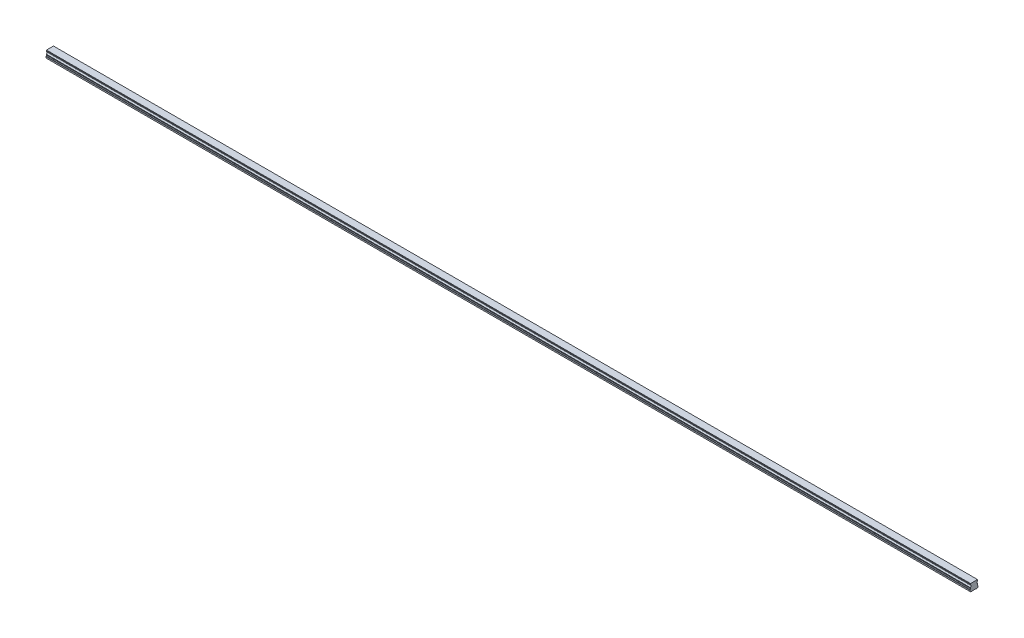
from build123d import *

# Parameters (mm, degrees)
BOSS_EXTRUDE1_DEPTH        = 1740
SKETCH3_R                  = 2.5
SKETCH3_R_2                = 2.1
CUT_EXTRUDE3_DEPTH         = 7
SKETCH3_2_R                = 2.1
CUT_EXTRUDE4_DEPTH         = 9.5
CHAMFER1_SIZE              = 0.4
LPATTERN2_COUNT            = 29
LPATTERN2_PITCH            = 60
CHAMFER1_OF_LPATTERN2_SIZE = 0.4


with BuildPart() as part:
    # Sketch1 → Boss-Extrude1 (new body)
    with BuildSketch(Plane(origin=(0, 0, 0), x_dir=(0, 0, -1), z_dir=(1, 0, 0))):
        with BuildLine():
            Line((6.59, 14), (-6.59, 14))
            Line((-6.59, 14), (-6.59, 13.15))
            Line((-6.59, 13.15), (-6.96, 12.356532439))
            Line((-6.96, 12.356532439), (-6.96, 11.435174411))
            ThreePointArc((-6.96, 11.435174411), (-5.25, 9.5), (-6.96, 7.564825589))
            Line((-6.96, 7.564825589), (-6.96, 6.643467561))
            Line((-6.96, 6.643467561), (-6.59, 5.85))
            Line((-6.59, 5.85), (-7.032116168, 4.2))
            Line((-7.032116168, 4.2), (-7.5, 3.929867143))
            Line((-7.5, 3.929867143), (-7.5, 1.4))
            Line((-7.5, 1.4), (-6.1, 0))
            Line((-6.1, 0), (-3.65, 0))
            Line((-3.65, 0), (-3.25, 0.4))
            Line((-3.25, 0.4), (3.25, 0.4))
            Line((3.25, 0.4), (3.65, 0))
            Line((3.65, 0), (6.1, 0))
            Line((6.1, 0), (7.5, 1.4))
            Line((7.5, 1.4), (7.5, 3.929867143))
            Line((7.5, 3.929867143), (7.032116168, 4.2))
            Line((7.032116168, 4.2), (6.59, 5.85))
            Line((6.59, 5.85), (6.96, 6.643467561))
            Line((6.96, 6.643467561), (6.96, 7.564825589))
            ThreePointArc((6.96, 7.564825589), (5.25, 9.5), (6.96, 11.435174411))
            Line((6.96, 11.435174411), (6.96, 12.356532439))
            Line((6.96, 12.356532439), (6.59, 13.15))
            Line((6.59, 13.15), (6.59, 14))
        make_face()
    extrude(amount=BOSS_EXTRUDE1_DEPTH)

    # Sketch3 → Cut-Extrude3 (cut)
    with BuildSketch(Plane.XZ):
        with Locations(Location((30, 0, 0), (0, 0, 270))):
            Circle(SKETCH3_R)
        with Locations(Location((30, 0, 0), (0, 0, 270))):
            Circle(SKETCH3_R_2, mode=Mode.SUBTRACT)
    cut_extrude3 = extrude(amount=-CUT_EXTRUDE3_DEPTH, mode=Mode.SUBTRACT)

    # Sketch3_2 → Cut-Extrude4 (cut)
    with BuildSketch(Plane.XZ):
        with Locations(Location((30, 0, 0), (0, 0, 270))):
            Circle(SKETCH3_2_R)
    cut_extrude4 = extrude(amount=-CUT_EXTRUDE4_DEPTH, mode=Mode.SUBTRACT)

    # Cut-Extrude5 cone 1 section (on through the dimple's axis) → Cut-Extrude5 (revolve, cut)
    with BuildSketch(Plane(origin=(30, 9.5, 0), x_dir=(0, 0, -1), z_dir=(1, 0, 0))):
        Polygon((0, 0), (2.1, 0), (0, 1.212435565), align=None)
    revolve(axis=Axis((30, 9.5, 0), (0, 1, 0)), mode=Mode.SUBTRACT)

    # Chamfer1
    chamfer1_edges = [part.edges().sort_by_distance(p)[0] for p in [
        (30, 0.4, 2.5),
    ]]
    chamfer(chamfer1_edges, length=CHAMFER1_SIZE)

    # LPattern2: Cut-Extrude3, Cut-Extrude4 ×29
    with Locations(*[(i * LPATTERN2_PITCH, 0, 0) for i in range(1, LPATTERN2_COUNT)]):
        add(cut_extrude3, mode=Mode.SUBTRACT)
        add(cut_extrude4, mode=Mode.SUBTRACT)

    # Chamfer1 of LPattern2
    chamfer1_of_lpattern2_edges = [part.edges().sort_by_distance(p)[0] for p in [
        (90, 0.4, 2.5),
        (150, 0.4, 2.5),
        (210, 0.4, 2.5),
        (270, 0.4, 2.5),
        (330, 0.4, 2.5),
        (390, 0.4, 2.5),
        (450, 0.4, 2.5),
        (510, 0.4, 2.5),
        (570, 0.4, 2.5),
        (630, 0.4, 2.5),
        (690, 0.4, 2.5),
        (750, 0.4, 2.5),
        (810, 0.4, 2.5),
        (870, 0.4, 2.5),
        (930, 0.4, 2.5),
        (990, 0.4, 2.5),
        (1050, 0.4, 2.5),
        (1110, 0.4, 2.5),
        (1170, 0.4, 2.5),
        (1230, 0.4, 2.5),
        (1290, 0.4, 2.5),
        (1350, 0.4, 2.5),
        (1410, 0.4, 2.5),
        (1470, 0.4, 2.5),
        (1530, 0.4, 2.5),
        (1590, 0.4, 2.5),
        (1650, 0.4, 2.5),
        (1710, 0.4, 2.5),
    ]]
    chamfer(chamfer1_of_lpattern2_edges, length=CHAMFER1_OF_LPATTERN2_SIZE)


solid = part.part
